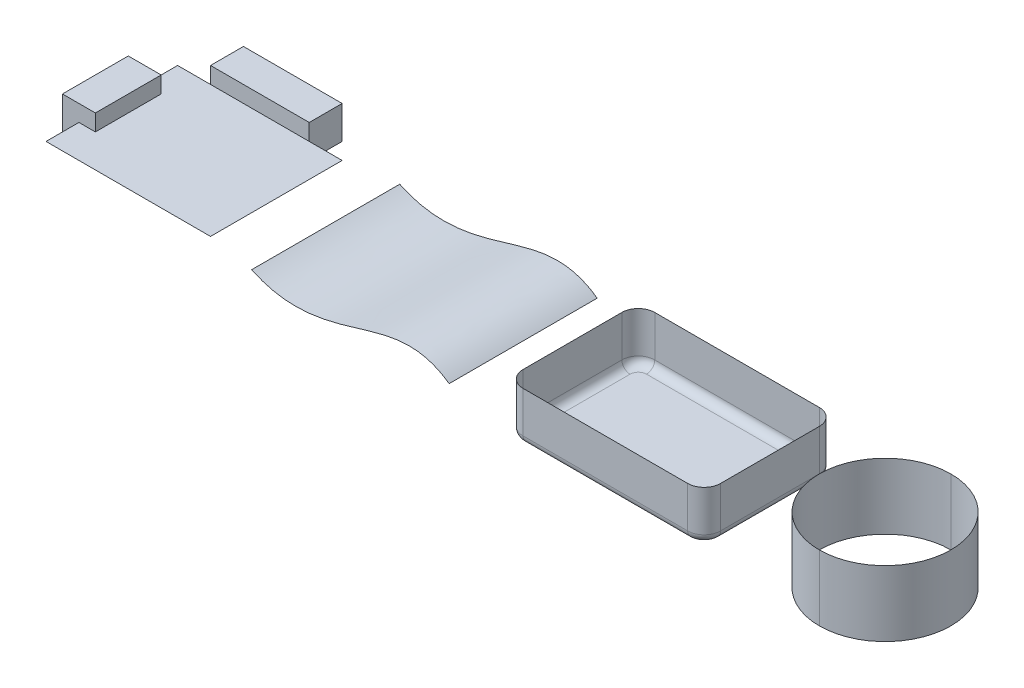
ISO-10303-21;
HEADER;
FILE_DESCRIPTION(('STEP AP214'),'2;1');
FILE_NAME('part.step','',(''),(''),'','','');
FILE_SCHEMA(('AUTOMOTIVE_DESIGN { 1 0 10303 214 1 1 1 1 }'));
ENDSEC;
DATA;
#1=APPLICATION_CONTEXT('core data for automotive mechanical design processes');
#2=APPLICATION_PROTOCOL_DEFINITION('international standard','automotive_design',2000,#1);
#3=PRODUCT_CONTEXT('',#1,'mechanical');
#4=PRODUCT('Part','Part','',(#3));
#5=PRODUCT_RELATED_PRODUCT_CATEGORY('part','',(#4));
#6=PRODUCT_DEFINITION_FORMATION('','',#4);
#7=PRODUCT_DEFINITION_CONTEXT('part definition',#1,'design');
#8=PRODUCT_DEFINITION('design','',#6,#7);
#9=PRODUCT_DEFINITION_SHAPE('','',#8);
#10=(LENGTH_UNIT() NAMED_UNIT(*) SI_UNIT(.MILLI.,.METRE.));
#11=(NAMED_UNIT(*) PLANE_ANGLE_UNIT() SI_UNIT($,.RADIAN.));
#12=(NAMED_UNIT(*) SI_UNIT($,.STERADIAN.) SOLID_ANGLE_UNIT());
#13=UNCERTAINTY_MEASURE_WITH_UNIT(LENGTH_MEASURE(1.E-05),#10,'distance_accuracy_value','');
#14=(GEOMETRIC_REPRESENTATION_CONTEXT(3) GLOBAL_UNCERTAINTY_ASSIGNED_CONTEXT((#13)) GLOBAL_UNIT_ASSIGNED_CONTEXT((#10,
#11,#12)) REPRESENTATION_CONTEXT('',''));
#15=CARTESIAN_POINT('',(0.,0.,0.));
#16=DIRECTION('',(0.,0.,1.));
#17=DIRECTION('',(1.,0.,0.));
#18=AXIS2_PLACEMENT_3D('',#15,#16,#17);
#19=CARTESIAN_POINT('',(110.,10.,-40.));
#20=DIRECTION('',(-1.,0.,0.));
#21=DIRECTION('',(0.,0.,1.));
#22=AXIS2_PLACEMENT_3D('',#19,#20,#21);
#23=PLANE('',#22);
#24=DIRECTION('',(0.,0.,-1.));
#25=VECTOR('',#24,1.);
#26=CARTESIAN_POINT('',(110.,-10.,-40.));
#27=LINE('',#26,#25);
#28=CARTESIAN_POINT('',(110.,-10.,-40.));
#29=VERTEX_POINT('',#28);
#30=CARTESIAN_POINT('',(110.,-10.,-60.));
#31=VERTEX_POINT('',#30);
#32=EDGE_CURVE('E12',#29,#31,#27,.T.);
#33=ORIENTED_EDGE('',*,*,#32,.T.);
#34=DIRECTION('',(0.,-1.,0.));
#35=VECTOR('',#34,1.);
#36=CARTESIAN_POINT('',(110.,10.,-60.));
#37=LINE('',#36,#35);
#38=CARTESIAN_POINT('',(110.,10.,-60.));
#39=VERTEX_POINT('',#38);
#40=EDGE_CURVE('E140',#39,#31,#37,.T.);
#41=ORIENTED_EDGE('',*,*,#40,.F.);
#42=DIRECTION('',(0.,0.,-1.));
#43=VECTOR('',#42,1.);
#44=CARTESIAN_POINT('',(110.,10.,-40.));
#45=LINE('',#44,#43);
#46=CARTESIAN_POINT('',(110.,10.,-40.));
#47=VERTEX_POINT('',#46);
#48=EDGE_CURVE('E64',#47,#39,#45,.T.);
#49=ORIENTED_EDGE('',*,*,#48,.F.);
#50=DIRECTION('',(0.,-1.,0.));
#51=VECTOR('',#50,1.);
#52=CARTESIAN_POINT('',(110.,10.,-40.));
#53=LINE('',#52,#51);
#54=EDGE_CURVE('E122',#47,#29,#53,.T.);
#55=ORIENTED_EDGE('',*,*,#54,.T.);
#56=EDGE_LOOP('',(#33,#41,#49,#55));
#57=FACE_BOUND('',#56,.T.);
#58=ADVANCED_FACE('F60',(#57),#23,.F.);
#59=CARTESIAN_POINT('',(50.,10.,-60.));
#60=DIRECTION('',(0.,0.,1.));
#61=DIRECTION('',(1.,0.,0.));
#62=AXIS2_PLACEMENT_3D('',#59,#60,#61);
#63=PLANE('',#62);
#64=DIRECTION('',(-1.,0.,0.));
#65=VECTOR('',#64,1.);
#66=CARTESIAN_POINT('',(50.,-10.,-60.));
#67=LINE('',#66,#65);
#68=CARTESIAN_POINT('',(50.,-10.,-60.));
#69=VERTEX_POINT('',#68);
#70=EDGE_CURVE('E71',#31,#69,#67,.T.);
#71=ORIENTED_EDGE('',*,*,#70,.T.);
#72=DIRECTION('',(0.,-1.,0.));
#73=VECTOR('',#72,1.);
#74=CARTESIAN_POINT('',(50.,10.,-60.));
#75=LINE('',#74,#73);
#76=CARTESIAN_POINT('',(50.,10.,-60.));
#77=VERTEX_POINT('',#76);
#78=EDGE_CURVE('E116',#77,#69,#75,.T.);
#79=ORIENTED_EDGE('',*,*,#78,.F.);
#80=DIRECTION('',(-1.,0.,0.));
#81=VECTOR('',#80,1.);
#82=CARTESIAN_POINT('',(50.,10.,-60.));
#83=LINE('',#82,#81);
#84=EDGE_CURVE('E95',#39,#77,#83,.T.);
#85=ORIENTED_EDGE('',*,*,#84,.F.);
#86=ORIENTED_EDGE('',*,*,#40,.T.);
#87=EDGE_LOOP('',(#71,#79,#85,#86));
#88=FACE_BOUND('',#87,.T.);
#89=ADVANCED_FACE('F144',(#88),#63,.F.);
#90=CARTESIAN_POINT('',(50.,10.,-40.));
#91=DIRECTION('',(1.,0.,0.));
#92=DIRECTION('',(0.,0.,-1.));
#93=AXIS2_PLACEMENT_3D('',#90,#91,#92);
#94=PLANE('',#93);
#95=DIRECTION('',(0.,0.,1.));
#96=VECTOR('',#95,1.);
#97=CARTESIAN_POINT('',(50.,-10.,-40.));
#98=LINE('',#97,#96);
#99=CARTESIAN_POINT('',(50.,-10.,-40.));
#100=VERTEX_POINT('',#99);
#101=EDGE_CURVE('E111',#69,#100,#98,.T.);
#102=ORIENTED_EDGE('',*,*,#101,.T.);
#103=DIRECTION('',(0.,-1.,0.));
#104=VECTOR('',#103,1.);
#105=CARTESIAN_POINT('',(50.,10.,-40.));
#106=LINE('',#105,#104);
#107=CARTESIAN_POINT('',(50.,10.,-40.));
#108=VERTEX_POINT('',#107);
#109=EDGE_CURVE('E114',#108,#100,#106,.T.);
#110=ORIENTED_EDGE('',*,*,#109,.F.);
#111=DIRECTION('',(0.,0.,1.));
#112=VECTOR('',#111,1.);
#113=CARTESIAN_POINT('',(50.,10.,-40.));
#114=LINE('',#113,#112);
#115=EDGE_CURVE('E134',#77,#108,#114,.T.);
#116=ORIENTED_EDGE('',*,*,#115,.F.);
#117=ORIENTED_EDGE('',*,*,#78,.T.);
#118=EDGE_LOOP('',(#102,#110,#116,#117));
#119=FACE_BOUND('',#118,.T.);
#120=ADVANCED_FACE('F112',(#119),#94,.F.);
#121=CARTESIAN_POINT('',(50.,10.,-40.));
#122=DIRECTION('',(0.,0.,-1.));
#123=DIRECTION('',(-1.,0.,0.));
#124=AXIS2_PLACEMENT_3D('',#121,#122,#123);
#125=PLANE('',#124);
#126=DIRECTION('',(1.,0.,0.));
#127=VECTOR('',#126,1.);
#128=CARTESIAN_POINT('',(50.,-10.,-40.));
#129=LINE('',#128,#127);
#130=EDGE_CURVE('E105',#100,#29,#129,.T.);
#131=ORIENTED_EDGE('',*,*,#130,.T.);
#132=ORIENTED_EDGE('',*,*,#54,.F.);
#133=DIRECTION('',(1.,0.,0.));
#134=VECTOR('',#133,1.);
#135=CARTESIAN_POINT('',(50.,10.,-40.));
#136=LINE('',#135,#134);
#137=EDGE_CURVE('E120',#108,#47,#136,.T.);
#138=ORIENTED_EDGE('',*,*,#137,.F.);
#139=ORIENTED_EDGE('',*,*,#109,.T.);
#140=EDGE_LOOP('',(#131,#132,#138,#139));
#141=FACE_BOUND('',#140,.T.);
#142=ADVANCED_FACE('F119',(#141),#125,.F.);
#143=CARTESIAN_POINT('',(0.,10.,0.));
#144=DIRECTION('',(0.,-1.,0.));
#145=DIRECTION('',(0.,0.,-1.));
#146=AXIS2_PLACEMENT_3D('',#143,#144,#145);
#147=PLANE('',#146);
#148=ORIENTED_EDGE('',*,*,#48,.T.);
#149=ORIENTED_EDGE('',*,*,#84,.T.);
#150=ORIENTED_EDGE('',*,*,#115,.T.);
#151=ORIENTED_EDGE('',*,*,#137,.T.);
#152=EDGE_LOOP('',(#148,#149,#150,#151));
#153=FACE_BOUND('',#152,.T.);
#154=ADVANCED_FACE('F62',(#153),#147,.F.);
#155=CARTESIAN_POINT('',(0.,-10.,0.));
#156=DIRECTION('',(0.,-1.,0.));
#157=DIRECTION('',(0.,0.,-1.));
#158=AXIS2_PLACEMENT_3D('',#155,#156,#157);
#159=PLANE('',#158);
#160=ORIENTED_EDGE('',*,*,#32,.F.);
#161=ORIENTED_EDGE('',*,*,#130,.F.);
#162=ORIENTED_EDGE('',*,*,#101,.F.);
#163=ORIENTED_EDGE('',*,*,#70,.F.);
#164=EDGE_LOOP('',(#160,#161,#162,#163));
#165=FACE_BOUND('',#164,.T.);
#166=ADVANCED_FACE('F124',(#165),#159,.T.);
#167=CLOSED_SHELL('',(#58,#89,#120,#142,#154,#166));
#168=MANIFOLD_SOLID_BREP('B2',#167);
#169=CARTESIAN_POINT('',(40.,10.,20.));
#170=DIRECTION('',(-1.,0.,0.));
#171=DIRECTION('',(0.,0.,1.));
#172=AXIS2_PLACEMENT_3D('',#169,#170,#171);
#173=PLANE('',#172);
#174=DIRECTION('',(0.,0.,-1.));
#175=VECTOR('',#174,1.);
#176=CARTESIAN_POINT('',(40.,-10.,20.));
#177=LINE('',#176,#175);
#178=CARTESIAN_POINT('',(40.,-10.,20.));
#179=VERTEX_POINT('',#178);
#180=CARTESIAN_POINT('',(40.,-10.,-20.));
#181=VERTEX_POINT('',#180);
#182=EDGE_CURVE('E269',#179,#181,#177,.T.);
#183=ORIENTED_EDGE('',*,*,#182,.T.);
#184=DIRECTION('',(0.,-1.,0.));
#185=VECTOR('',#184,1.);
#186=CARTESIAN_POINT('',(40.,10.,-20.));
#187=LINE('',#186,#185);
#188=CARTESIAN_POINT('',(40.,10.,-20.));
#189=VERTEX_POINT('',#188);
#190=EDGE_CURVE('E58',#189,#181,#187,.T.);
#191=ORIENTED_EDGE('',*,*,#190,.F.);
#192=DIRECTION('',(0.,0.,-1.));
#193=VECTOR('',#192,1.);
#194=CARTESIAN_POINT('',(40.,10.,20.));
#195=LINE('',#194,#193);
#196=CARTESIAN_POINT('',(40.,10.,20.));
#197=VERTEX_POINT('',#196);
#198=EDGE_CURVE('E257',#197,#189,#195,.T.);
#199=ORIENTED_EDGE('',*,*,#198,.F.);
#200=DIRECTION('',(0.,-1.,0.));
#201=VECTOR('',#200,1.);
#202=CARTESIAN_POINT('',(40.,10.,20.));
#203=LINE('',#202,#201);
#204=EDGE_CURVE('E265',#197,#179,#203,.T.);
#205=ORIENTED_EDGE('',*,*,#204,.T.);
#206=EDGE_LOOP('',(#183,#191,#199,#205));
#207=FACE_BOUND('',#206,.T.);
#208=ADVANCED_FACE('F206',(#207),#173,.F.);
#209=CARTESIAN_POINT('',(20.,10.,-20.));
#210=DIRECTION('',(0.,0.,1.));
#211=DIRECTION('',(1.,0.,0.));
#212=AXIS2_PLACEMENT_3D('',#209,#210,#211);
#213=PLANE('',#212);
#214=DIRECTION('',(-1.,0.,0.));
#215=VECTOR('',#214,1.);
#216=CARTESIAN_POINT('',(20.,-10.,-20.));
#217=LINE('',#216,#215);
#218=CARTESIAN_POINT('',(20.,-10.,-20.));
#219=VERTEX_POINT('',#218);
#220=EDGE_CURVE('E261',#181,#219,#217,.T.);
#221=ORIENTED_EDGE('',*,*,#220,.T.);
#222=DIRECTION('',(0.,-1.,0.));
#223=VECTOR('',#222,1.);
#224=CARTESIAN_POINT('',(20.,10.,-20.));
#225=LINE('',#224,#223);
#226=CARTESIAN_POINT('',(20.,10.,-20.));
#227=VERTEX_POINT('',#226);
#228=EDGE_CURVE('E214',#227,#219,#225,.T.);
#229=ORIENTED_EDGE('',*,*,#228,.F.);
#230=DIRECTION('',(-1.,0.,0.));
#231=VECTOR('',#230,1.);
#232=CARTESIAN_POINT('',(20.,10.,-20.));
#233=LINE('',#232,#231);
#234=EDGE_CURVE('E252',#189,#227,#233,.T.);
#235=ORIENTED_EDGE('',*,*,#234,.F.);
#236=ORIENTED_EDGE('',*,*,#190,.T.);
#237=EDGE_LOOP('',(#221,#229,#235,#236));
#238=FACE_BOUND('',#237,.T.);
#239=ADVANCED_FACE('F260',(#238),#213,.F.);
#240=CARTESIAN_POINT('',(20.,10.,20.));
#241=DIRECTION('',(1.,0.,0.));
#242=DIRECTION('',(0.,0.,-1.));
#243=AXIS2_PLACEMENT_3D('',#240,#241,#242);
#244=PLANE('',#243);
#245=DIRECTION('',(0.,0.,1.));
#246=VECTOR('',#245,1.);
#247=CARTESIAN_POINT('',(20.,-10.,20.));
#248=LINE('',#247,#246);
#249=CARTESIAN_POINT('',(20.,-10.,20.));
#250=VERTEX_POINT('',#249);
#251=EDGE_CURVE('E239',#219,#250,#248,.T.);
#252=ORIENTED_EDGE('',*,*,#251,.T.);
#253=DIRECTION('',(0.,-1.,0.));
#254=VECTOR('',#253,1.);
#255=CARTESIAN_POINT('',(20.,10.,20.));
#256=LINE('',#255,#254);
#257=CARTESIAN_POINT('',(20.,10.,20.));
#258=VERTEX_POINT('',#257);
#259=EDGE_CURVE('E262',#258,#250,#256,.T.);
#260=ORIENTED_EDGE('',*,*,#259,.F.);
#261=DIRECTION('',(0.,0.,1.));
#262=VECTOR('',#261,1.);
#263=CARTESIAN_POINT('',(20.,10.,20.));
#264=LINE('',#263,#262);
#265=EDGE_CURVE('E255',#227,#258,#264,.T.);
#266=ORIENTED_EDGE('',*,*,#265,.F.);
#267=ORIENTED_EDGE('',*,*,#228,.T.);
#268=EDGE_LOOP('',(#252,#260,#266,#267));
#269=FACE_BOUND('',#268,.T.);
#270=ADVANCED_FACE('F263',(#269),#244,.F.);
#271=CARTESIAN_POINT('',(20.,10.,20.));
#272=DIRECTION('',(0.,0.,-1.));
#273=DIRECTION('',(-1.,0.,0.));
#274=AXIS2_PLACEMENT_3D('',#271,#272,#273);
#275=PLANE('',#274);
#276=DIRECTION('',(1.,0.,0.));
#277=VECTOR('',#276,1.);
#278=CARTESIAN_POINT('',(20.,-10.,20.));
#279=LINE('',#278,#277);
#280=EDGE_CURVE('E245',#250,#179,#279,.T.);
#281=ORIENTED_EDGE('',*,*,#280,.T.);
#282=ORIENTED_EDGE('',*,*,#204,.F.);
#283=DIRECTION('',(1.,0.,0.));
#284=VECTOR('',#283,1.);
#285=CARTESIAN_POINT('',(20.,10.,20.));
#286=LINE('',#285,#284);
#287=EDGE_CURVE('E222',#258,#197,#286,.T.);
#288=ORIENTED_EDGE('',*,*,#287,.F.);
#289=ORIENTED_EDGE('',*,*,#259,.T.);
#290=EDGE_LOOP('',(#281,#282,#288,#289));
#291=FACE_BOUND('',#290,.T.);
#292=ADVANCED_FACE('F276',(#291),#275,.F.);
#293=CARTESIAN_POINT('',(0.,10.,0.));
#294=DIRECTION('',(0.,-1.,0.));
#295=DIRECTION('',(0.,0.,-1.));
#296=AXIS2_PLACEMENT_3D('',#293,#294,#295);
#297=PLANE('',#296);
#298=ORIENTED_EDGE('',*,*,#198,.T.);
#299=ORIENTED_EDGE('',*,*,#234,.T.);
#300=ORIENTED_EDGE('',*,*,#265,.T.);
#301=ORIENTED_EDGE('',*,*,#287,.T.);
#302=EDGE_LOOP('',(#298,#299,#300,#301));
#303=FACE_BOUND('',#302,.T.);
#304=ADVANCED_FACE('F253',(#303),#297,.F.);
#305=CARTESIAN_POINT('',(0.,-10.,0.));
#306=DIRECTION('',(0.,-1.,0.));
#307=DIRECTION('',(0.,0.,-1.));
#308=AXIS2_PLACEMENT_3D('',#305,#306,#307);
#309=PLANE('',#308);
#310=ORIENTED_EDGE('',*,*,#182,.F.);
#311=ORIENTED_EDGE('',*,*,#280,.F.);
#312=ORIENTED_EDGE('',*,*,#251,.F.);
#313=ORIENTED_EDGE('',*,*,#220,.F.);
#314=EDGE_LOOP('',(#310,#311,#312,#313));
#315=FACE_BOUND('',#314,.T.);
#316=ADVANCED_FACE('F279',(#315),#309,.T.);
#317=CLOSED_SHELL('',(#208,#239,#270,#292,#304,#316));
#318=MANIFOLD_SOLID_BREP('B6',#317);
#319=CARTESIAN_POINT('',(500.,-20.,0.));
#320=DIRECTION('',(0.,1.,0.));
#321=DIRECTION('',(0.,0.,1.));
#322=AXIS2_PLACEMENT_3D('',#319,#320,#321);
#323=CYLINDRICAL_SURFACE('',#322,40.);
#324=CARTESIAN_POINT('',(500.,20.,0.));
#325=DIRECTION('',(0.,-1.,0.));
#326=DIRECTION('',(0.,0.,-1.));
#327=AXIS2_PLACEMENT_3D('',#324,#325,#326);
#328=CIRCLE('',#327,40.);
#329=CARTESIAN_POINT('',(500.,20.,-40.));
#330=VERTEX_POINT('',#329);
#331=CARTESIAN_POINT('',(500.,20.,40.));
#332=VERTEX_POINT('',#331);
#333=EDGE_CURVE('E359',#330,#332,#328,.T.);
#334=ORIENTED_EDGE('',*,*,#333,.F.);
#335=DIRECTION('',(0.,1.,0.));
#336=VECTOR('',#335,1.);
#337=CARTESIAN_POINT('',(500.,-20.,-40.));
#338=LINE('',#337,#336);
#339=CARTESIAN_POINT('',(500.,-20.,-40.));
#340=VERTEX_POINT('',#339);
#341=EDGE_CURVE('E341',#340,#330,#338,.T.);
#342=ORIENTED_EDGE('',*,*,#341,.F.);
#343=CARTESIAN_POINT('',(500.,-20.,0.));
#344=DIRECTION('',(0.,-1.,0.));
#345=DIRECTION('',(0.,0.,-1.));
#346=AXIS2_PLACEMENT_3D('',#343,#344,#345);
#347=CIRCLE('',#346,40.);
#348=CARTESIAN_POINT('',(500.,-20.,40.));
#349=VERTEX_POINT('',#348);
#350=EDGE_CURVE('E347',#340,#349,#347,.T.);
#351=ORIENTED_EDGE('',*,*,#350,.T.);
#352=DIRECTION('',(0.,1.,0.));
#353=VECTOR('',#352,1.);
#354=CARTESIAN_POINT('',(500.,-20.,40.));
#355=LINE('',#354,#353);
#356=EDGE_CURVE('E204',#349,#332,#355,.T.);
#357=ORIENTED_EDGE('',*,*,#356,.T.);
#358=EDGE_LOOP('',(#334,#342,#351,#357));
#359=FACE_BOUND('',#358,.T.);
#360=ADVANCED_FACE('F340',(#359),#323,.F.);
#361=OPEN_SHELL('',(#360));
#362=SHELL_BASED_SURFACE_MODEL('B52',(#361));
#363=CARTESIAN_POINT('',(500.,-20.,0.));
#364=DIRECTION('',(0.,1.,0.));
#365=DIRECTION('',(0.,0.,1.));
#366=AXIS2_PLACEMENT_3D('',#363,#364,#365);
#367=CYLINDRICAL_SURFACE('',#366,40.);
#368=CARTESIAN_POINT('',(500.,20.,0.));
#369=DIRECTION('',(0.,1.,0.));
#370=DIRECTION('',(0.,0.,1.));
#371=AXIS2_PLACEMENT_3D('',#368,#369,#370);
#372=CIRCLE('',#371,40.);
#373=CARTESIAN_POINT('',(500.,20.,-40.));
#374=VERTEX_POINT('',#373);
#375=CARTESIAN_POINT('',(500.,20.,40.));
#376=VERTEX_POINT('',#375);
#377=EDGE_CURVE('E411',#374,#376,#372,.T.);
#378=ORIENTED_EDGE('',*,*,#377,.F.);
#379=DIRECTION('',(0.,1.,0.));
#380=VECTOR('',#379,1.);
#381=CARTESIAN_POINT('',(500.,-20.,-40.));
#382=LINE('',#381,#380);
#383=CARTESIAN_POINT('',(500.,-20.,-40.));
#384=VERTEX_POINT('',#383);
#385=EDGE_CURVE('E393',#384,#374,#382,.T.);
#386=ORIENTED_EDGE('',*,*,#385,.F.);
#387=CARTESIAN_POINT('',(500.,-20.,0.));
#388=DIRECTION('',(0.,1.,0.));
#389=DIRECTION('',(0.,0.,1.));
#390=AXIS2_PLACEMENT_3D('',#387,#388,#389);
#391=CIRCLE('',#390,40.);
#392=CARTESIAN_POINT('',(500.,-20.,40.));
#393=VERTEX_POINT('',#392);
#394=EDGE_CURVE('E399',#384,#393,#391,.T.);
#395=ORIENTED_EDGE('',*,*,#394,.T.);
#396=DIRECTION('',(0.,1.,0.));
#397=VECTOR('',#396,1.);
#398=CARTESIAN_POINT('',(500.,-20.,40.));
#399=LINE('',#398,#397);
#400=EDGE_CURVE('E338',#393,#376,#399,.T.);
#401=ORIENTED_EDGE('',*,*,#400,.T.);
#402=EDGE_LOOP('',(#378,#386,#395,#401));
#403=FACE_BOUND('',#402,.T.);
#404=ADVANCED_FACE('F392',(#403),#367,.T.);
#405=OPEN_SHELL('',(#404));
#406=SHELL_BASED_SURFACE_MODEL('B198',(#405));
#407=CARTESIAN_POINT('',(420.,15.,-30.));
#408=DIRECTION('',(0.,-1.,0.));
#409=DIRECTION('',(0.,0.,-1.));
#410=AXIS2_PLACEMENT_3D('',#407,#408,#409);
#411=CYLINDRICAL_SURFACE('',#410,10.);
#412=DIRECTION('',(0.,-1.,0.));
#413=VECTOR('',#412,1.);
#414=CARTESIAN_POINT('',(420.,15.,-40.));
#415=LINE('',#414,#413);
#416=CARTESIAN_POINT('',(420.,15.,-40.));
#417=VERTEX_POINT('',#416);
#418=CARTESIAN_POINT('',(420.,-10.,-40.));
#419=VERTEX_POINT('',#418);
#420=EDGE_CURVE('E634',#417,#419,#415,.T.);
#421=ORIENTED_EDGE('',*,*,#420,.T.);
#422=CARTESIAN_POINT('',(420.,-10.,-30.));
#423=DIRECTION('',(0.,1.,0.));
#424=DIRECTION('',(0.,0.,1.));
#425=AXIS2_PLACEMENT_3D('',#422,#423,#424);
#426=CIRCLE('',#425,10.);
#427=CARTESIAN_POINT('',(430.,-10.,-30.));
#428=VERTEX_POINT('',#427);
#429=EDGE_CURVE('E580',#419,#428,#426,.F.);
#430=ORIENTED_EDGE('',*,*,#429,.T.);
#431=DIRECTION('',(0.,-1.,0.));
#432=VECTOR('',#431,1.);
#433=CARTESIAN_POINT('',(430.,15.,-30.));
#434=LINE('',#433,#432);
#435=CARTESIAN_POINT('',(430.,15.,-30.));
#436=VERTEX_POINT('',#435);
#437=EDGE_CURVE('E551',#436,#428,#434,.T.);
#438=ORIENTED_EDGE('',*,*,#437,.F.);
#439=CARTESIAN_POINT('',(420.,15.,-30.));
#440=DIRECTION('',(0.,1.,0.));
#441=DIRECTION('',(0.,0.,1.));
#442=AXIS2_PLACEMENT_3D('',#439,#440,#441);
#443=CIRCLE('',#442,10.);
#444=EDGE_CURVE('E565',#436,#417,#443,.T.);
#445=ORIENTED_EDGE('',*,*,#444,.T.);
#446=EDGE_LOOP('',(#421,#430,#438,#445));
#447=FACE_BOUND('',#446,.T.);
#448=ADVANCED_FACE('F444',(#447),#411,.F.);
#449=CARTESIAN_POINT('',(420.,15.,-40.));
#450=DIRECTION('',(0.,0.,1.));
#451=DIRECTION('',(1.,0.,0.));
#452=AXIS2_PLACEMENT_3D('',#449,#450,#451);
#453=PLANE('',#452);
#454=DIRECTION('',(0.,-1.,0.));
#455=VECTOR('',#454,1.);
#456=CARTESIAN_POINT('',(320.,15.,-40.));
#457=LINE('',#456,#455);
#458=CARTESIAN_POINT('',(320.,15.,-40.));
#459=VERTEX_POINT('',#458);
#460=CARTESIAN_POINT('',(320.,-10.,-40.));
#461=VERTEX_POINT('',#460);
#462=EDGE_CURVE('E635',#459,#461,#457,.T.);
#463=ORIENTED_EDGE('',*,*,#462,.T.);
#464=DIRECTION('',(-1.,0.,0.));
#465=VECTOR('',#464,1.);
#466=CARTESIAN_POINT('',(420.,-10.,-40.));
#467=LINE('',#466,#465);
#468=EDGE_CURVE('E390',#461,#419,#467,.F.);
#469=ORIENTED_EDGE('',*,*,#468,.T.);
#470=ORIENTED_EDGE('',*,*,#420,.F.);
#471=DIRECTION('',(-1.,0.,0.));
#472=VECTOR('',#471,1.);
#473=CARTESIAN_POINT('',(420.,15.,-40.));
#474=LINE('',#473,#472);
#475=EDGE_CURVE('E640',#417,#459,#474,.T.);
#476=ORIENTED_EDGE('',*,*,#475,.T.);
#477=EDGE_LOOP('',(#463,#469,#470,#476));
#478=FACE_BOUND('',#477,.T.);
#479=ADVANCED_FACE('F633',(#478),#453,.T.);
#480=CARTESIAN_POINT('',(320.,15.,-30.));
#481=DIRECTION('',(0.,-1.,0.));
#482=DIRECTION('',(0.,0.,-1.));
#483=AXIS2_PLACEMENT_3D('',#480,#481,#482);
#484=CYLINDRICAL_SURFACE('',#483,10.);
#485=DIRECTION('',(0.,-1.,0.));
#486=VECTOR('',#485,1.);
#487=CARTESIAN_POINT('',(310.,15.,-30.));
#488=LINE('',#487,#486);
#489=CARTESIAN_POINT('',(310.,15.,-30.));
#490=VERTEX_POINT('',#489);
#491=CARTESIAN_POINT('',(310.,-10.,-30.));
#492=VERTEX_POINT('',#491);
#493=EDGE_CURVE('E785',#490,#492,#488,.T.);
#494=ORIENTED_EDGE('',*,*,#493,.T.);
#495=CARTESIAN_POINT('',(320.,-10.,-30.));
#496=DIRECTION('',(0.,1.,0.));
#497=DIRECTION('',(0.,0.,1.));
#498=AXIS2_PLACEMENT_3D('',#495,#496,#497);
#499=CIRCLE('',#498,10.);
#500=EDGE_CURVE('E451',#492,#461,#499,.F.);
#501=ORIENTED_EDGE('',*,*,#500,.T.);
#502=ORIENTED_EDGE('',*,*,#462,.F.);
#503=CARTESIAN_POINT('',(320.,15.,-30.));
#504=DIRECTION('',(0.,1.,0.));
#505=DIRECTION('',(0.,0.,1.));
#506=AXIS2_PLACEMENT_3D('',#503,#504,#505);
#507=CIRCLE('',#506,10.);
#508=EDGE_CURVE('E641',#459,#490,#507,.T.);
#509=ORIENTED_EDGE('',*,*,#508,.T.);
#510=EDGE_LOOP('',(#494,#501,#502,#509));
#511=FACE_BOUND('',#510,.T.);
#512=ADVANCED_FACE('F686',(#511),#484,.F.);
#513=CARTESIAN_POINT('',(310.,15.,30.));
#514=DIRECTION('',(1.,0.,0.));
#515=DIRECTION('',(0.,0.,-1.));
#516=AXIS2_PLACEMENT_3D('',#513,#514,#515);
#517=PLANE('',#516);
#518=DIRECTION('',(0.,-1.,0.));
#519=VECTOR('',#518,1.);
#520=CARTESIAN_POINT('',(310.,15.,30.));
#521=LINE('',#520,#519);
#522=CARTESIAN_POINT('',(310.,15.,30.));
#523=VERTEX_POINT('',#522);
#524=CARTESIAN_POINT('',(310.,-10.,30.));
#525=VERTEX_POINT('',#524);
#526=EDGE_CURVE('E781',#523,#525,#521,.T.);
#527=ORIENTED_EDGE('',*,*,#526,.T.);
#528=DIRECTION('',(0.,0.,1.));
#529=VECTOR('',#528,1.);
#530=CARTESIAN_POINT('',(310.,-10.,-30.));
#531=LINE('',#530,#529);
#532=EDGE_CURVE('E466',#525,#492,#531,.F.);
#533=ORIENTED_EDGE('',*,*,#532,.T.);
#534=ORIENTED_EDGE('',*,*,#493,.F.);
#535=DIRECTION('',(0.,0.,1.));
#536=VECTOR('',#535,1.);
#537=CARTESIAN_POINT('',(310.,15.,30.));
#538=LINE('',#537,#536);
#539=EDGE_CURVE('E787',#490,#523,#538,.T.);
#540=ORIENTED_EDGE('',*,*,#539,.T.);
#541=EDGE_LOOP('',(#527,#533,#534,#540));
#542=FACE_BOUND('',#541,.T.);
#543=ADVANCED_FACE('F689',(#542),#517,.T.);
#544=CARTESIAN_POINT('',(320.,15.,30.));
#545=DIRECTION('',(0.,-1.,0.));
#546=DIRECTION('',(0.,0.,-1.));
#547=AXIS2_PLACEMENT_3D('',#544,#545,#546);
#548=CYLINDRICAL_SURFACE('',#547,10.);
#549=DIRECTION('',(0.,-1.,0.));
#550=VECTOR('',#549,1.);
#551=CARTESIAN_POINT('',(320.,15.,40.));
#552=LINE('',#551,#550);
#553=CARTESIAN_POINT('',(320.,15.,40.));
#554=VERTEX_POINT('',#553);
#555=CARTESIAN_POINT('',(320.,-10.,40.));
#556=VERTEX_POINT('',#555);
#557=EDGE_CURVE('E544',#554,#556,#552,.T.);
#558=ORIENTED_EDGE('',*,*,#557,.T.);
#559=CARTESIAN_POINT('',(320.,-10.,30.));
#560=DIRECTION('',(0.,1.,0.));
#561=DIRECTION('',(0.,0.,1.));
#562=AXIS2_PLACEMENT_3D('',#559,#560,#561);
#563=CIRCLE('',#562,10.);
#564=EDGE_CURVE('E588',#556,#525,#563,.F.);
#565=ORIENTED_EDGE('',*,*,#564,.T.);
#566=ORIENTED_EDGE('',*,*,#526,.F.);
#567=CARTESIAN_POINT('',(320.,15.,30.));
#568=DIRECTION('',(0.,1.,0.));
#569=DIRECTION('',(0.,0.,-1.));
#570=AXIS2_PLACEMENT_3D('',#567,#568,#569);
#571=CIRCLE('',#570,10.);
#572=EDGE_CURVE('E778',#523,#554,#571,.T.);
#573=ORIENTED_EDGE('',*,*,#572,.T.);
#574=EDGE_LOOP('',(#558,#565,#566,#573));
#575=FACE_BOUND('',#574,.T.);
#576=ADVANCED_FACE('F692',(#575),#548,.F.);
#577=CARTESIAN_POINT('',(420.,15.,40.));
#578=DIRECTION('',(0.,0.,-1.));
#579=DIRECTION('',(-1.,0.,0.));
#580=AXIS2_PLACEMENT_3D('',#577,#578,#579);
#581=PLANE('',#580);
#582=DIRECTION('',(0.,-1.,0.));
#583=VECTOR('',#582,1.);
#584=CARTESIAN_POINT('',(420.,15.,40.));
#585=LINE('',#584,#583);
#586=CARTESIAN_POINT('',(420.,15.,40.));
#587=VERTEX_POINT('',#586);
#588=CARTESIAN_POINT('',(420.,-10.,40.));
#589=VERTEX_POINT('',#588);
#590=EDGE_CURVE('E542',#587,#589,#585,.T.);
#591=ORIENTED_EDGE('',*,*,#590,.T.);
#592=DIRECTION('',(1.,0.,0.));
#593=VECTOR('',#592,1.);
#594=CARTESIAN_POINT('',(320.,-10.,40.));
#595=LINE('',#594,#593);
#596=EDGE_CURVE('E586',#589,#556,#595,.F.);
#597=ORIENTED_EDGE('',*,*,#596,.T.);
#598=ORIENTED_EDGE('',*,*,#557,.F.);
#599=DIRECTION('',(1.,0.,0.));
#600=VECTOR('',#599,1.);
#601=CARTESIAN_POINT('',(420.,15.,40.));
#602=LINE('',#601,#600);
#603=EDGE_CURVE('E660',#554,#587,#602,.T.);
#604=ORIENTED_EDGE('',*,*,#603,.T.);
#605=EDGE_LOOP('',(#591,#597,#598,#604));
#606=FACE_BOUND('',#605,.T.);
#607=ADVANCED_FACE('F656',(#606),#581,.T.);
#608=CARTESIAN_POINT('',(420.,15.,30.));
#609=DIRECTION('',(0.,-1.,0.));
#610=DIRECTION('',(0.,0.,-1.));
#611=AXIS2_PLACEMENT_3D('',#608,#609,#610);
#612=CYLINDRICAL_SURFACE('',#611,10.);
#613=DIRECTION('',(0.,-1.,0.));
#614=VECTOR('',#613,1.);
#615=CARTESIAN_POINT('',(430.,15.,30.));
#616=LINE('',#615,#614);
#617=CARTESIAN_POINT('',(430.,15.,30.));
#618=VERTEX_POINT('',#617);
#619=CARTESIAN_POINT('',(430.,-10.,30.));
#620=VERTEX_POINT('',#619);
#621=EDGE_CURVE('E539',#618,#620,#616,.T.);
#622=ORIENTED_EDGE('',*,*,#621,.T.);
#623=CARTESIAN_POINT('',(420.,-10.,30.));
#624=DIRECTION('',(0.,1.,0.));
#625=DIRECTION('',(0.,0.,1.));
#626=AXIS2_PLACEMENT_3D('',#623,#624,#625);
#627=CIRCLE('',#626,10.);
#628=EDGE_CURVE('E584',#620,#589,#627,.F.);
#629=ORIENTED_EDGE('',*,*,#628,.T.);
#630=ORIENTED_EDGE('',*,*,#590,.F.);
#631=CARTESIAN_POINT('',(420.,15.,30.));
#632=DIRECTION('',(0.,1.,0.));
#633=DIRECTION('',(0.,0.,1.));
#634=AXIS2_PLACEMENT_3D('',#631,#632,#633);
#635=CIRCLE('',#634,10.);
#636=EDGE_CURVE('E535',#587,#618,#635,.T.);
#637=ORIENTED_EDGE('',*,*,#636,.T.);
#638=EDGE_LOOP('',(#622,#629,#630,#637));
#639=FACE_BOUND('',#638,.T.);
#640=ADVANCED_FACE('F537',(#639),#612,.F.);
#641=CARTESIAN_POINT('',(430.,15.,30.));
#642=DIRECTION('',(-1.,0.,0.));
#643=DIRECTION('',(0.,0.,1.));
#644=AXIS2_PLACEMENT_3D('',#641,#642,#643);
#645=PLANE('',#644);
#646=ORIENTED_EDGE('',*,*,#437,.T.);
#647=DIRECTION('',(0.,0.,-1.));
#648=VECTOR('',#647,1.);
#649=CARTESIAN_POINT('',(430.,-10.,30.));
#650=LINE('',#649,#648);
#651=EDGE_CURVE('E555',#428,#620,#650,.F.);
#652=ORIENTED_EDGE('',*,*,#651,.T.);
#653=ORIENTED_EDGE('',*,*,#621,.F.);
#654=DIRECTION('',(0.,0.,-1.));
#655=VECTOR('',#654,1.);
#656=CARTESIAN_POINT('',(430.,15.,30.));
#657=LINE('',#656,#655);
#658=EDGE_CURVE('E546',#618,#436,#657,.T.);
#659=ORIENTED_EDGE('',*,*,#658,.T.);
#660=EDGE_LOOP('',(#646,#652,#653,#659));
#661=FACE_BOUND('',#660,.T.);
#662=ADVANCED_FACE('F553',(#661),#645,.T.);
#663=CARTESIAN_POINT('',(320.,-15.,30.));
#664=DIRECTION('',(0.,1.,0.));
#665=DIRECTION('',(0.,0.,1.));
#666=AXIS2_PLACEMENT_3D('',#663,#664,#665);
#667=PLANE('',#666);
#668=DIRECTION('',(0.,0.,-1.));
#669=VECTOR('',#668,1.);
#670=CARTESIAN_POINT('',(425.,-15.,-30.));
#671=LINE('',#670,#669);
#672=CARTESIAN_POINT('',(425.,-15.,30.));
#673=VERTEX_POINT('',#672);
#674=CARTESIAN_POINT('',(425.,-15.,-30.));
#675=VERTEX_POINT('',#674);
#676=EDGE_CURVE('E575',#673,#675,#671,.T.);
#677=ORIENTED_EDGE('',*,*,#676,.T.);
#678=CARTESIAN_POINT('',(420.,-15.,-30.));
#679=DIRECTION('',(0.,1.,0.));
#680=DIRECTION('',(0.,0.,1.));
#681=AXIS2_PLACEMENT_3D('',#678,#679,#680);
#682=CIRCLE('',#681,5.00000000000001);
#683=CARTESIAN_POINT('',(420.,-15.,-35.));
#684=VERTEX_POINT('',#683);
#685=EDGE_CURVE('E577',#675,#684,#682,.T.);
#686=ORIENTED_EDGE('',*,*,#685,.T.);
#687=DIRECTION('',(-1.,0.,0.));
#688=VECTOR('',#687,1.);
#689=CARTESIAN_POINT('',(320.,-15.,-35.));
#690=LINE('',#689,#688);
#691=CARTESIAN_POINT('',(320.,-15.,-35.));
#692=VERTEX_POINT('',#691);
#693=EDGE_CURVE('E562',#684,#692,#690,.T.);
#694=ORIENTED_EDGE('',*,*,#693,.T.);
#695=CARTESIAN_POINT('',(320.,-15.,-30.));
#696=DIRECTION('',(0.,1.,0.));
#697=DIRECTION('',(0.,0.,1.));
#698=AXIS2_PLACEMENT_3D('',#695,#696,#697);
#699=CIRCLE('',#698,5.00000000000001);
#700=CARTESIAN_POINT('',(315.,-15.,-30.));
#701=VERTEX_POINT('',#700);
#702=EDGE_CURVE('E564',#692,#701,#699,.T.);
#703=ORIENTED_EDGE('',*,*,#702,.T.);
#704=DIRECTION('',(0.,0.,1.));
#705=VECTOR('',#704,1.);
#706=CARTESIAN_POINT('',(315.,-15.,30.));
#707=LINE('',#706,#705);
#708=CARTESIAN_POINT('',(315.,-15.,30.));
#709=VERTEX_POINT('',#708);
#710=EDGE_CURVE('E567',#701,#709,#707,.T.);
#711=ORIENTED_EDGE('',*,*,#710,.T.);
#712=CARTESIAN_POINT('',(320.,-15.,30.));
#713=DIRECTION('',(0.,1.,0.));
#714=DIRECTION('',(0.,0.,1.));
#715=AXIS2_PLACEMENT_3D('',#712,#713,#714);
#716=CIRCLE('',#715,5.);
#717=CARTESIAN_POINT('',(320.,-15.,35.));
#718=VERTEX_POINT('',#717);
#719=EDGE_CURVE('E569',#709,#718,#716,.T.);
#720=ORIENTED_EDGE('',*,*,#719,.T.);
#721=DIRECTION('',(1.,0.,0.));
#722=VECTOR('',#721,1.);
#723=CARTESIAN_POINT('',(420.,-15.,35.));
#724=LINE('',#723,#722);
#725=CARTESIAN_POINT('',(420.,-15.,35.));
#726=VERTEX_POINT('',#725);
#727=EDGE_CURVE('E571',#718,#726,#724,.T.);
#728=ORIENTED_EDGE('',*,*,#727,.T.);
#729=CARTESIAN_POINT('',(420.,-15.,30.));
#730=DIRECTION('',(0.,1.,0.));
#731=DIRECTION('',(0.,0.,1.));
#732=AXIS2_PLACEMENT_3D('',#729,#730,#731);
#733=CIRCLE('',#732,5.00000000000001);
#734=EDGE_CURVE('E573',#726,#673,#733,.T.);
#735=ORIENTED_EDGE('',*,*,#734,.T.);
#736=EDGE_LOOP('',(#677,#686,#694,#703,#711,#720,#728,#735));
#737=FACE_BOUND('',#736,.T.);
#738=ADVANCED_FACE('F619',(#737),#667,.T.);
#739=CARTESIAN_POINT('',(320.,-10.,30.));
#740=DIRECTION('',(0.,1.,0.));
#741=DIRECTION('',(0.,0.,1.));
#742=AXIS2_PLACEMENT_3D('',#739,#740,#741);
#743=TOROIDAL_SURFACE('',#742,5.,5.);
#744=CARTESIAN_POINT('',(315.,-10.,30.));
#745=DIRECTION('',(0.,0.,1.));
#746=DIRECTION('',(1.,0.,0.));
#747=AXIS2_PLACEMENT_3D('',#744,#745,#746);
#748=CIRCLE('',#747,5.);
#749=EDGE_CURVE('E558',#525,#709,#748,.T.);
#750=ORIENTED_EDGE('',*,*,#749,.F.);
#751=ORIENTED_EDGE('',*,*,#564,.F.);
#752=CARTESIAN_POINT('',(320.,-10.,35.));
#753=DIRECTION('',(-1.,0.,0.));
#754=DIRECTION('',(0.,0.,1.));
#755=AXIS2_PLACEMENT_3D('',#752,#753,#754);
#756=CIRCLE('',#755,5.);
#757=EDGE_CURVE('E447',#718,#556,#756,.T.);
#758=ORIENTED_EDGE('',*,*,#757,.F.);
#759=ORIENTED_EDGE('',*,*,#719,.F.);
#760=EDGE_LOOP('',(#750,#751,#758,#759));
#761=FACE_BOUND('',#760,.T.);
#762=ADVANCED_FACE('F445',(#761),#743,.F.);
#763=CARTESIAN_POINT('',(320.,-10.,35.));
#764=DIRECTION('',(-1.,0.,0.));
#765=DIRECTION('',(0.,0.,1.));
#766=AXIS2_PLACEMENT_3D('',#763,#764,#765);
#767=CYLINDRICAL_SURFACE('',#766,5.);
#768=ORIENTED_EDGE('',*,*,#757,.T.);
#769=ORIENTED_EDGE('',*,*,#596,.F.);
#770=CARTESIAN_POINT('',(420.,-10.,35.));
#771=DIRECTION('',(-1.,0.,0.));
#772=DIRECTION('',(0.,0.,1.));
#773=AXIS2_PLACEMENT_3D('',#770,#771,#772);
#774=CIRCLE('',#773,5.);
#775=EDGE_CURVE('E605',#726,#589,#774,.T.);
#776=ORIENTED_EDGE('',*,*,#775,.F.);
#777=ORIENTED_EDGE('',*,*,#727,.F.);
#778=EDGE_LOOP('',(#768,#769,#776,#777));
#779=FACE_BOUND('',#778,.T.);
#780=ADVANCED_FACE('F662',(#779),#767,.F.);
#781=CARTESIAN_POINT('',(315.,-10.,30.));
#782=DIRECTION('',(0.,0.,-1.));
#783=DIRECTION('',(-1.,0.,0.));
#784=AXIS2_PLACEMENT_3D('',#781,#782,#783);
#785=CYLINDRICAL_SURFACE('',#784,5.);
#786=ORIENTED_EDGE('',*,*,#749,.T.);
#787=ORIENTED_EDGE('',*,*,#710,.F.);
#788=CARTESIAN_POINT('',(315.,-10.,-30.));
#789=DIRECTION('',(0.,0.,1.));
#790=DIRECTION('',(1.,0.,0.));
#791=AXIS2_PLACEMENT_3D('',#788,#789,#790);
#792=CIRCLE('',#791,5.);
#793=EDGE_CURVE('E602',#492,#701,#792,.T.);
#794=ORIENTED_EDGE('',*,*,#793,.F.);
#795=ORIENTED_EDGE('',*,*,#532,.F.);
#796=EDGE_LOOP('',(#786,#787,#794,#795));
#797=FACE_BOUND('',#796,.T.);
#798=ADVANCED_FACE('F611',(#797),#785,.F.);
#799=CARTESIAN_POINT('',(420.,-10.,30.));
#800=DIRECTION('',(0.,1.,0.));
#801=DIRECTION('',(0.,0.,1.));
#802=AXIS2_PLACEMENT_3D('',#799,#800,#801);
#803=TOROIDAL_SURFACE('',#802,5.00000000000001,5.);
#804=ORIENTED_EDGE('',*,*,#775,.T.);
#805=ORIENTED_EDGE('',*,*,#628,.F.);
#806=CARTESIAN_POINT('',(425.,-10.,30.));
#807=DIRECTION('',(0.,0.,1.));
#808=DIRECTION('',(1.,0.,0.));
#809=AXIS2_PLACEMENT_3D('',#806,#807,#808);
#810=CIRCLE('',#809,5.);
#811=EDGE_CURVE('E599',#673,#620,#810,.T.);
#812=ORIENTED_EDGE('',*,*,#811,.F.);
#813=ORIENTED_EDGE('',*,*,#734,.F.);
#814=EDGE_LOOP('',(#804,#805,#812,#813));
#815=FACE_BOUND('',#814,.T.);
#816=ADVANCED_FACE('F653',(#815),#803,.F.);
#817=CARTESIAN_POINT('',(320.,-10.,-30.));
#818=DIRECTION('',(0.,1.,0.));
#819=DIRECTION('',(0.,0.,1.));
#820=AXIS2_PLACEMENT_3D('',#817,#818,#819);
#821=TOROIDAL_SURFACE('',#820,5.00000000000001,5.);
#822=ORIENTED_EDGE('',*,*,#793,.T.);
#823=ORIENTED_EDGE('',*,*,#702,.F.);
#824=CARTESIAN_POINT('',(320.,-10.,-35.));
#825=DIRECTION('',(-1.,0.,0.));
#826=DIRECTION('',(0.,0.,1.));
#827=AXIS2_PLACEMENT_3D('',#824,#825,#826);
#828=CIRCLE('',#827,5.);
#829=EDGE_CURVE('E596',#461,#692,#828,.T.);
#830=ORIENTED_EDGE('',*,*,#829,.F.);
#831=ORIENTED_EDGE('',*,*,#500,.F.);
#832=EDGE_LOOP('',(#822,#823,#830,#831));
#833=FACE_BOUND('',#832,.T.);
#834=ADVANCED_FACE('F625',(#833),#821,.F.);
#835=CARTESIAN_POINT('',(425.,-10.,30.));
#836=DIRECTION('',(0.,0.,1.));
#837=DIRECTION('',(1.,0.,0.));
#838=AXIS2_PLACEMENT_3D('',#835,#836,#837);
#839=CYLINDRICAL_SURFACE('',#838,5.);
#840=ORIENTED_EDGE('',*,*,#811,.T.);
#841=ORIENTED_EDGE('',*,*,#651,.F.);
#842=CARTESIAN_POINT('',(425.,-10.,-30.));
#843=DIRECTION('',(0.,0.,1.));
#844=DIRECTION('',(1.,0.,0.));
#845=AXIS2_PLACEMENT_3D('',#842,#843,#844);
#846=CIRCLE('',#845,5.);
#847=EDGE_CURVE('E594',#675,#428,#846,.T.);
#848=ORIENTED_EDGE('',*,*,#847,.F.);
#849=ORIENTED_EDGE('',*,*,#676,.F.);
#850=EDGE_LOOP('',(#840,#841,#848,#849));
#851=FACE_BOUND('',#850,.T.);
#852=ADVANCED_FACE('F649',(#851),#839,.F.);
#853=CARTESIAN_POINT('',(320.,-10.,-35.));
#854=DIRECTION('',(1.,0.,0.));
#855=DIRECTION('',(0.,0.,-1.));
#856=AXIS2_PLACEMENT_3D('',#853,#854,#855);
#857=CYLINDRICAL_SURFACE('',#856,5.);
#858=ORIENTED_EDGE('',*,*,#829,.T.);
#859=ORIENTED_EDGE('',*,*,#693,.F.);
#860=CARTESIAN_POINT('',(420.,-10.,-35.));
#861=DIRECTION('',(-1.,0.,0.));
#862=DIRECTION('',(0.,0.,1.));
#863=AXIS2_PLACEMENT_3D('',#860,#861,#862);
#864=CIRCLE('',#863,5.);
#865=EDGE_CURVE('E592',#419,#684,#864,.T.);
#866=ORIENTED_EDGE('',*,*,#865,.F.);
#867=ORIENTED_EDGE('',*,*,#468,.F.);
#868=EDGE_LOOP('',(#858,#859,#866,#867));
#869=FACE_BOUND('',#868,.T.);
#870=ADVANCED_FACE('F628',(#869),#857,.F.);
#871=CARTESIAN_POINT('',(420.,-10.,-30.));
#872=DIRECTION('',(0.,1.,0.));
#873=DIRECTION('',(0.,0.,1.));
#874=AXIS2_PLACEMENT_3D('',#871,#872,#873);
#875=TOROIDAL_SURFACE('',#874,5.00000000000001,5.);
#876=ORIENTED_EDGE('',*,*,#847,.T.);
#877=ORIENTED_EDGE('',*,*,#429,.F.);
#878=ORIENTED_EDGE('',*,*,#865,.T.);
#879=ORIENTED_EDGE('',*,*,#685,.F.);
#880=EDGE_LOOP('',(#876,#877,#878,#879));
#881=FACE_BOUND('',#880,.T.);
#882=ADVANCED_FACE('F644',(#881),#875,.F.);
#883=OPEN_SHELL('',(#448,#479,#512,#543,#576,#607,#640,#662,#738,#762,#780,#798,#816,#834,#852,
#870,#882));
#884=SHELL_BASED_SURFACE_MODEL('B332',(#883));
#885=CARTESIAN_POINT('',(160.,0.,-45.));
#886=CARTESIAN_POINT('',(180.318210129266,-9.69535193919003,-45.));
#887=CARTESIAN_POINT('',(220.21747725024,-1.98980584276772,-45.));
#888=CARTESIAN_POINT('',(260.55323836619,14.0612285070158,-45.));
#889=CARTESIAN_POINT('',(280.,0.,-45.));
#890=B_SPLINE_CURVE_WITH_KNOTS('',3,(#885,#886,#887,#888,#889),.UNSPECIFIED.,.F.,.F.,(4,1,4),
(0.,0.495929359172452,1.),.UNSPECIFIED.);
#891=DIRECTION('',(0.,0.,1.));
#892=VECTOR('',#891,1.);
#893=SURFACE_OF_LINEAR_EXTRUSION('',#890,#892);
#894=CARTESIAN_POINT('',(160.,0.,45.));
#895=CARTESIAN_POINT('',(180.318210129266,-9.69535193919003,45.));
#896=CARTESIAN_POINT('',(220.21747725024,-1.98980584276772,45.));
#897=CARTESIAN_POINT('',(260.55323836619,14.0612285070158,45.));
#898=CARTESIAN_POINT('',(280.,0.,45.));
#899=B_SPLINE_CURVE_WITH_KNOTS('',3,(#894,#895,#896,#897,#898),.UNSPECIFIED.,.F.,.F.,(4,1,4),
(0.,0.495929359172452,1.),.UNSPECIFIED.);
#900=CARTESIAN_POINT('',(160.,0.,45.));
#901=VERTEX_POINT('',#900);
#902=CARTESIAN_POINT('',(280.,0.,45.));
#903=VERTEX_POINT('',#902);
#904=EDGE_CURVE('E848',#901,#903,#899,.T.);
#905=ORIENTED_EDGE('',*,*,#904,.F.);
#906=DIRECTION('',(0.,0.,1.));
#907=VECTOR('',#906,1.);
#908=CARTESIAN_POINT('',(160.,0.,-45.));
#909=LINE('',#908,#907);
#910=CARTESIAN_POINT('',(160.,0.,-45.));
#911=VERTEX_POINT('',#910);
#912=EDGE_CURVE('E830',#911,#901,#909,.T.);
#913=ORIENTED_EDGE('',*,*,#912,.F.);
#914=CARTESIAN_POINT('',(280.,0.,-45.));
#915=VERTEX_POINT('',#914);
#916=EDGE_CURVE('E836',#911,#915,#890,.T.);
#917=ORIENTED_EDGE('',*,*,#916,.T.);
#918=DIRECTION('',(0.,0.,1.));
#919=VECTOR('',#918,1.);
#920=CARTESIAN_POINT('',(280.,0.,-45.));
#921=LINE('',#920,#919);
#922=EDGE_CURVE('E442',#915,#903,#921,.T.);
#923=ORIENTED_EDGE('',*,*,#922,.T.);
#924=EDGE_LOOP('',(#905,#913,#917,#923));
#925=FACE_BOUND('',#924,.T.);
#926=ADVANCED_FACE('F828',(#925),#893,.T.);
#927=OPEN_SHELL('',(#926));
#928=SHELL_BASED_SURFACE_MODEL('B384',(#927));
#929=CARTESIAN_POINT('',(0.,0.,0.));
#930=DIRECTION('',(0.,1.,0.));
#931=DIRECTION('',(0.,0.,1.));
#932=AXIS2_PLACEMENT_3D('',#929,#930,#931);
#933=PLANE('',#932);
#934=DIRECTION('',(0.,0.,1.));
#935=VECTOR('',#934,1.);
#936=CARTESIAN_POINT('',(30.,0.,40.));
#937=LINE('',#936,#935);
#938=CARTESIAN_POINT('',(30.,0.,-40.));
#939=VERTEX_POINT('',#938);
#940=CARTESIAN_POINT('',(30.,0.,40.));
#941=VERTEX_POINT('',#940);
#942=EDGE_CURVE('E890',#939,#941,#937,.T.);
#943=ORIENTED_EDGE('',*,*,#942,.T.);
#944=DIRECTION('',(1.,0.,0.));
#945=VECTOR('',#944,1.);
#946=CARTESIAN_POINT('',(130.,0.,40.));
#947=LINE('',#946,#945);
#948=CARTESIAN_POINT('',(130.,0.,40.));
#949=VERTEX_POINT('',#948);
#950=EDGE_CURVE('E901',#941,#949,#947,.T.);
#951=ORIENTED_EDGE('',*,*,#950,.T.);
#952=DIRECTION('',(0.,0.,-1.));
#953=VECTOR('',#952,1.);
#954=CARTESIAN_POINT('',(130.,0.,40.));
#955=LINE('',#954,#953);
#956=CARTESIAN_POINT('',(130.,0.,-40.));
#957=VERTEX_POINT('',#956);
#958=EDGE_CURVE('E886',#949,#957,#955,.T.);
#959=ORIENTED_EDGE('',*,*,#958,.T.);
#960=DIRECTION('',(-1.,0.,0.));
#961=VECTOR('',#960,1.);
#962=CARTESIAN_POINT('',(130.,0.,-40.));
#963=LINE('',#962,#961);
#964=EDGE_CURVE('E826',#957,#939,#963,.T.);
#965=ORIENTED_EDGE('',*,*,#964,.T.);
#966=EDGE_LOOP('',(#943,#951,#959,#965));
#967=FACE_BOUND('',#966,.T.);
#968=ADVANCED_FACE('F881',(#967),#933,.T.);
#969=OPEN_SHELL('',(#968));
#970=SHELL_BASED_SURFACE_MODEL('B436',(#969));
#971=ADVANCED_BREP_SHAPE_REPRESENTATION('',(#18,#168,#318),#14);
#972=MANIFOLD_SURFACE_SHAPE_REPRESENTATION('',(#18,#362,#406,#884,#928,#970),#14);
#973=SHAPE_REPRESENTATION('',(#18),#14);
#974=SHAPE_DEFINITION_REPRESENTATION(#9,#973);
#975=SHAPE_REPRESENTATION_RELATIONSHIP('','',#973,#971);
#976=SHAPE_REPRESENTATION_RELATIONSHIP('','',#973,#972);
ENDSEC;
END-ISO-10303-21;
